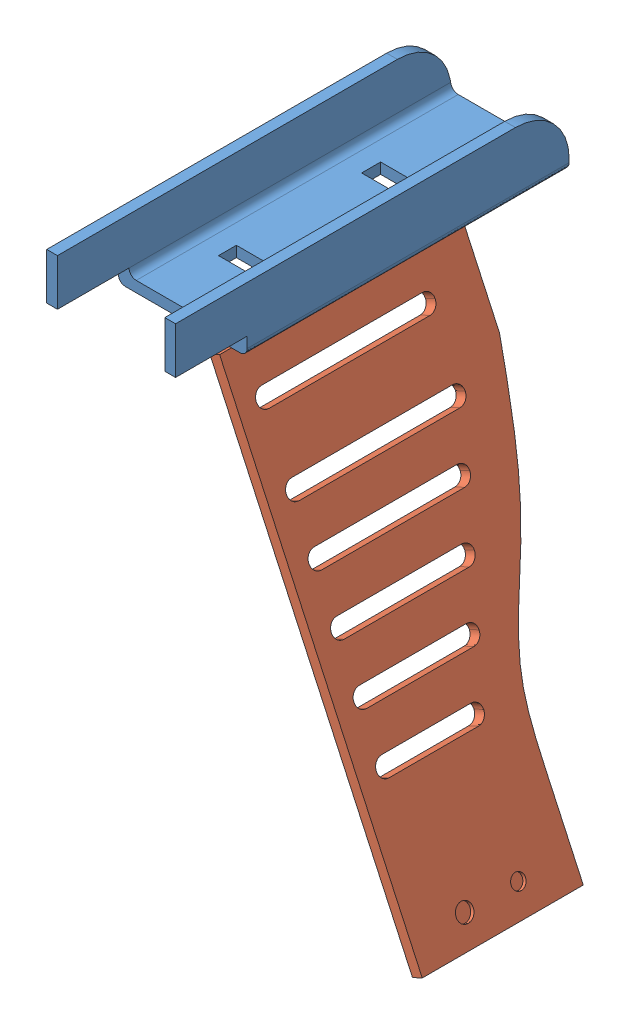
SolidWorks assembly Ass2_ass1-porte.SLDASM, configuration Défaut (file format 3800). Lengths in mm.
Overall size (78.67 151.39 110).
5 component instances, 3 part files, 1 mates.
Components (placement in the parent):
- Ass1_poteau_gond-1: Ass1_poteau_gond.SLDASM [Défaut] at (29.3493 -2.5257 0) size (36 27 110)
  - poteau_bis-1: poteau_bis.SLDPRT [Défaut] at (-24.972 6.6916 55) size (36 18 110)
  - gond_marron-1: gond_marron.SLDPRT [Défaut] at (-2.472 -5.3084 12.5761) x (0 0 1) z (-1 0 0) size (20 15 10)
  - gond_marron-2: gond_marron.SLDPRT [Défaut] at (-2.472 -5.3084 -26.9968) x (0 0 1) z (-1 0 0) size (20 15 10)
- porte-1: porte.SLDPRT [Défaut] at (20.6999 -9.6778 28.7249) x (0.419451 -0.907778 0) z (0.907778 0.419451 0) size (145 67.51 3)
Mates (geometry in assembly coordinates):
- Parallèle1: parallel anti-aligned: line of Ass1_poteau_gond-1/poteau_bis-1; line of porte-1
